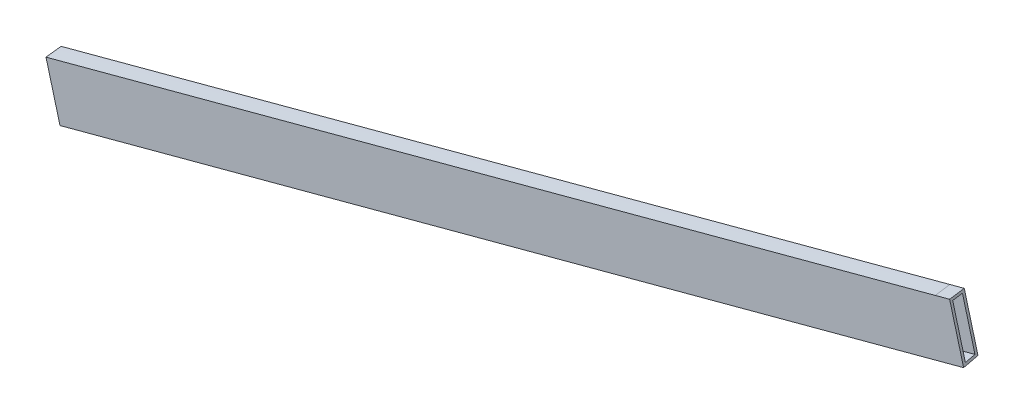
from build123d import *

# Parameters (mm, degrees)
BOSS_EXTRUDE1_DEPTH = 25.4
SKETCH8_W           = 11.481663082
SKETCH8_H           = 22.903248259
CUT_EXTRUDE1_DEPTH  = 304.115587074
CUT_EXTRUDE2_DEPTH  = 25.4
BOSS_EXTRUDE2_DEPTH = 4.699


with BuildPart() as part:
    # Sketch1 → Boss-Extrude1 (new body)
    with BuildSketch(Plane(origin=(0, 0, 0), x_dir=(0, 0, -1), z_dir=(1, 0, 0))):
        with BuildLine():
            Line((32.54375, 18.223643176), (32.54375, 2.186214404))
            add(Edge.make_bspline(
                [(32.54375, 2.186214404), (33.60192669, 2.387238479), (34.660215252, 2.587677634), (35.71875, 2.786807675)],
                knots=[0.623360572, 0.623360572, 0.623360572, 0.623360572, 0.633917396, 0.633917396, 0.633917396, 0.633917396], degree=3))
            Line((35.71875, 2.786807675), (35.71875, 18.610370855))
            add(Edge.make_bspline(
                [(35.71875, 18.610370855), (34.657913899, 18.504004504), (33.599137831, 18.374784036), (32.54375, 18.223643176)],
                knots=[0.37069791, 0.37069791, 0.37069791, 0.37069791, 0.381261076, 0.381261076, 0.381261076, 0.381261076], degree=3))
        make_face()
        with BuildLine():
            Line((33.3375, 17.532319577), (33.3375, 3.14477122))
            add(Edge.make_bspline(
                [(33.3375, 3.14477122), (33.866623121, 3.245077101), (34.395784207, 3.345183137), (34.925, 3.444998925)],
                knots=[0.626491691, 0.626491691, 0.626491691, 0.626491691, 0.631767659, 0.631767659, 0.631767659, 0.631767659], degree=3))
            Line((34.925, 3.444998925), (34.925, 17.727804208))
            add(Edge.make_bspline(
                [(34.925, 17.727804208), (34.395165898, 17.668312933), (33.865942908, 17.603111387), (33.3375, 17.532319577)],
                knots=[0.373628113, 0.373628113, 0.373628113, 0.373628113, 0.378966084, 0.378966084, 0.378966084, 0.378966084], degree=3))
        make_face(mode=Mode.SUBTRACT)
    extrude(amount=BOSS_EXTRUDE1_DEPTH)

    # Sketch8 → Cut-Extrude1 (cut, through all)
    with BuildSketch(Plane.ZY.offset(-25.4)):
        with Locations((-33.918665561, 11.804508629)):
            Rectangle(SKETCH8_W, SKETCH8_H)
    extrude(amount=CUT_EXTRUDE1_DEPTH, mode=Mode.SUBTRACT)


with BuildPart() as body_2:
    # Sweep1: sweep along a path in Sketch4
    with BuildLine(Plane.XY.offset(-32.54375)) as sweep1_path:
        Line((25.4, 2.186214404), (310.61406, 78.609091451))
    # Sketch7 → Sweep1 (sweep)
    with BuildSketch(Plane(origin=(25.4, 0, 0), x_dir=(0, 0, -1), z_dir=(1, 0, 0))):
        with BuildLine():
            Line((31.75, 18.911819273), (31.75, 1.227477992))
            add(Edge.make_bspline(
                [(31.75, 1.227477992), (33.337270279, 1.5290151), (34.924692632, 1.829757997), (36.5125, 2.128454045)],
                knots=[0.620228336, 0.620228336, 0.620228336, 0.620228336, 0.636068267, 0.636068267, 0.636068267, 0.636068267], degree=3))
            Line((36.5125, 2.128454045), (36.5125, 19.487687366))
            add(Edge.make_bspline(
                [(36.5125, 19.487687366), (34.921414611, 19.328154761), (33.332913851, 19.138506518), (31.75, 18.911819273)],
                knots=[0.367800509, 0.367800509, 0.367800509, 0.367800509, 0.383533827, 0.383533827, 0.383533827, 0.383533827], degree=3))
        make_face()
        with BuildLine():
            Line((32.54375, 18.223643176), (32.54375, 2.186214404))
            add(Edge.make_bspline(
                [(32.54375, 2.186214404), (33.60192669, 2.387238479), (34.660215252, 2.587677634), (35.71875, 2.786807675)],
                knots=[0.623360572, 0.623360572, 0.623360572, 0.623360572, 0.633917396, 0.633917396, 0.633917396, 0.633917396], degree=3))
            Line((35.71875, 2.786807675), (35.71875, 18.610370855))
            add(Edge.make_bspline(
                [(35.71875, 18.610370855), (34.657913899, 18.504004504), (33.599137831, 18.374784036), (32.54375, 18.223643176)],
                knots=[0.37069791, 0.37069791, 0.37069791, 0.37069791, 0.381261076, 0.381261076, 0.381261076, 0.381261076], degree=3))
        make_face(mode=Mode.SUBTRACT)
    sweep(path=sweep1_path.line)

    # Sketch9 → Cut-Extrude2 (cut)
    with BuildSketch(Plane.XY.offset(-31.75)):
        Polygon((25.4, 18.911819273), (29.82108532, 2.412104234), (25.4, 1.227477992), align=None)
        Polygon((310.61406, 77.650355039), (306.049007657, 94.687362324), (310.61406, 95.910564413), align=None)
    extrude(amount=-CUT_EXTRUDE2_DEPTH, mode=Mode.SUBTRACT)

    # Sketch10 → Boss-Extrude2 (add)
    with BuildSketch(Plane(origin=(309.219452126, 82.855102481, 0), x_dir=(0, 0, -1), z_dir=(0.9659258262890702, 0.25881904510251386, 0))):
        with BuildLine():
            Line((31.75, 11.693410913), (31.75, -5.388351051))
            add(Edge.make_bspline(
                [(31.75, -5.388351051), (32.147281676, -5.315450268), (32.544572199, -5.242597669), (32.941875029, -5.16981226), (33.339177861, -5.097026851), (33.736493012, -5.02430863), (34.133823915, -4.951676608), (34.926644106, -4.806749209), (35.719527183, -4.66216498), (36.5125, -4.518075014)],
                knots=[0, 0, 0, 0, 0.001211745, 0.001211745, 0.001211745, 0.002423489, 0.002423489, 0.002423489, 0.004841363, 0.004841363, 0.004841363, 0.004841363], degree=3))
            Line((36.5125, -4.518075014), (36.5125, 12.249656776))
            add(Edge.make_bspline(
                [(36.5125, 12.249656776), (34.921506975, 12.095569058), (33.333368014, 11.912436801), (31.75, 11.693410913)],
                knots=[0, 0, 0, 0, 1, 1, 1, 1], degree=3))
        make_face()
        with BuildLine():
            Line((32.54375, -4.462282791), (32.54375, 11.028683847))
            add(Edge.make_bspline(
                [(32.54375, 11.028683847), (33.599428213, 11.174714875), (34.657982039, 11.299498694), (35.71875, 11.4022341)],
                knots=[0, 0, 0, 0, 1, 1, 1, 1], degree=3))
            Line((35.71875, 11.4022341), (35.71875, -3.88215424))
            add(Edge.make_bspline(
                [(35.71875, -3.88215424), (35.453812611, -3.930295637), (35.18888964, -3.97851643), (34.923979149, -4.026805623), (34.65906866, -4.075094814), (34.394170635, -4.123452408), (34.129283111, -4.171867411), (33.600735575, -4.268473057), (33.072229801, -4.365307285), (32.54375, -4.462282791)],
                knots=[0, 0, 0, 0, 0.000807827, 0.000807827, 0.000807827, 0.001615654, 0.001615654, 0.001615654, 0.003227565, 0.003227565, 0.003227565, 0.003227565], degree=3))
        make_face(mode=Mode.SUBTRACT)
    extrude(amount=BOSS_EXTRUDE2_DEPTH)


solid = body_2.part
